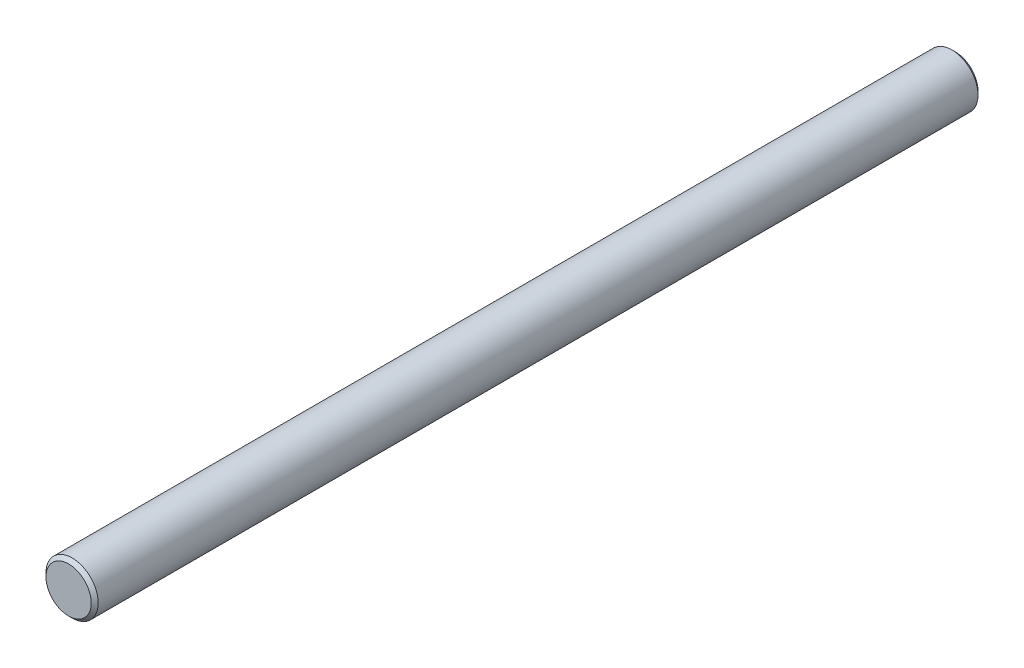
ISO-10303-21;
HEADER;
FILE_DESCRIPTION(('STEP AP214'),'2;1');
FILE_NAME('part.step','',(''),(''),'','','');
FILE_SCHEMA(('AUTOMOTIVE_DESIGN { 1 0 10303 214 1 1 1 1 }'));
ENDSEC;
DATA;
#1=APPLICATION_CONTEXT('core data for automotive mechanical design processes');
#2=APPLICATION_PROTOCOL_DEFINITION('international standard','automotive_design',2000,#1);
#3=PRODUCT_CONTEXT('',#1,'mechanical');
#4=PRODUCT('Part','Part','',(#3));
#5=PRODUCT_RELATED_PRODUCT_CATEGORY('part','',(#4));
#6=PRODUCT_DEFINITION_FORMATION('','',#4);
#7=PRODUCT_DEFINITION_CONTEXT('part definition',#1,'design');
#8=PRODUCT_DEFINITION('design','',#6,#7);
#9=PRODUCT_DEFINITION_SHAPE('','',#8);
#10=(LENGTH_UNIT() NAMED_UNIT(*) SI_UNIT(.MILLI.,.METRE.));
#11=(NAMED_UNIT(*) PLANE_ANGLE_UNIT() SI_UNIT($,.RADIAN.));
#12=(NAMED_UNIT(*) SI_UNIT($,.STERADIAN.) SOLID_ANGLE_UNIT());
#13=UNCERTAINTY_MEASURE_WITH_UNIT(LENGTH_MEASURE(1.E-05),#10,'distance_accuracy_value','');
#14=(GEOMETRIC_REPRESENTATION_CONTEXT(3) GLOBAL_UNCERTAINTY_ASSIGNED_CONTEXT((#13)) GLOBAL_UNIT_ASSIGNED_CONTEXT((#10,
#11,#12)) REPRESENTATION_CONTEXT('',''));
#15=CARTESIAN_POINT('',(0.,0.,0.));
#16=DIRECTION('',(0.,0.,1.));
#17=DIRECTION('',(1.,0.,0.));
#18=AXIS2_PLACEMENT_3D('',#15,#16,#17);
#19=CARTESIAN_POINT('',(-0.6578,-0.6578,-25.5));
#20=DIRECTION('',(0.,0.,1.));
#21=DIRECTION('',(1.,0.,0.));
#22=AXIS2_PLACEMENT_3D('',#19,#20,#21);
#23=PLANE('',#22);
#24=CARTESIAN_POINT('',(0.,0.,-25.5));
#25=DIRECTION('',(0.,0.,1.));
#26=DIRECTION('',(1.,0.,0.));
#27=AXIS2_PLACEMENT_3D('',#24,#25,#26);
#28=CIRCLE('',#27,0.650000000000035);
#29=CARTESIAN_POINT('',(0.650000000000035,0.,-25.5));
#30=VERTEX_POINT('',#29);
#31=EDGE_CURVE('E19',#30,#30,#28,.F.);
#32=ORIENTED_EDGE('',*,*,#31,.T.);
#33=EDGE_LOOP('',(#32));
#34=FACE_BOUND('',#33,.T.);
#35=ADVANCED_FACE('F15',(#34),#23,.F.);
#36=CARTESIAN_POINT('',(0.,0.,-25.5));
#37=DIRECTION('',(0.,0.,1.));
#38=DIRECTION('',(1.,0.,0.));
#39=AXIS2_PLACEMENT_3D('',#36,#37,#38);
#40=CONICAL_SURFACE('',#39,0.65,0.785398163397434);
#41=ORIENTED_EDGE('',*,*,#31,.F.);
#42=EDGE_LOOP('',(#41));
#43=FACE_BOUND('',#42,.T.);
#44=CARTESIAN_POINT('',(0.,0.,-25.4));
#45=DIRECTION('',(0.,0.,1.));
#46=DIRECTION('',(1.,0.,0.));
#47=AXIS2_PLACEMENT_3D('',#44,#45,#46);
#48=CIRCLE('',#47,0.75);
#49=CARTESIAN_POINT('',(0.75,0.,-25.4));
#50=VERTEX_POINT('',#49);
#51=EDGE_CURVE('E27',#50,#50,#48,.F.);
#52=ORIENTED_EDGE('',*,*,#51,.T.);
#53=EDGE_LOOP('',(#52));
#54=FACE_BOUND('',#53,.T.);
#55=ADVANCED_FACE('F37',(#43,#54),#40,.T.);
#56=CARTESIAN_POINT('',(0.,0.,-25.4));
#57=DIRECTION('',(0.,0.,1.));
#58=DIRECTION('',(1.,0.,0.));
#59=AXIS2_PLACEMENT_3D('',#56,#57,#58);
#60=CYLINDRICAL_SURFACE('',#59,0.75);
#61=CARTESIAN_POINT('',(0.,0.,-0.099999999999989));
#62=DIRECTION('',(0.,0.,-1.));
#63=DIRECTION('',(-1.,0.,0.));
#64=AXIS2_PLACEMENT_3D('',#61,#62,#63);
#65=CIRCLE('',#64,0.75);
#66=CARTESIAN_POINT('',(-0.75,0.,-0.1));
#67=VERTEX_POINT('',#66);
#68=EDGE_CURVE('E23',#67,#67,#65,.T.);
#69=ORIENTED_EDGE('',*,*,#68,.T.);
#70=EDGE_LOOP('',(#69));
#71=FACE_BOUND('',#70,.T.);
#72=ORIENTED_EDGE('',*,*,#51,.F.);
#73=EDGE_LOOP('',(#72));
#74=FACE_BOUND('',#73,.T.);
#75=ADVANCED_FACE('F39',(#71,#74),#60,.T.);
#76=CARTESIAN_POINT('',(-0.6578,-0.6578,0.));
#77=DIRECTION('',(0.,0.,1.));
#78=DIRECTION('',(1.,0.,0.));
#79=AXIS2_PLACEMENT_3D('',#76,#77,#78);
#80=PLANE('',#79);
#81=CARTESIAN_POINT('',(0.,0.,0.));
#82=DIRECTION('',(0.,0.,-1.));
#83=DIRECTION('',(-1.,0.,0.));
#84=AXIS2_PLACEMENT_3D('',#81,#82,#83);
#85=CIRCLE('',#84,0.65);
#86=CARTESIAN_POINT('',(-0.65,0.,0.));
#87=VERTEX_POINT('',#86);
#88=EDGE_CURVE('E10',#87,#87,#85,.F.);
#89=ORIENTED_EDGE('',*,*,#88,.T.);
#90=EDGE_LOOP('',(#89));
#91=FACE_BOUND('',#90,.T.);
#92=ADVANCED_FACE('F17',(#91),#80,.T.);
#93=CARTESIAN_POINT('',(0.,0.,0.));
#94=DIRECTION('',(0.,0.,-1.));
#95=DIRECTION('',(-1.,0.,0.));
#96=AXIS2_PLACEMENT_3D('',#93,#94,#95);
#97=CONICAL_SURFACE('',#96,0.65,0.785398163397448);
#98=ORIENTED_EDGE('',*,*,#88,.F.);
#99=EDGE_LOOP('',(#98));
#100=FACE_BOUND('',#99,.T.);
#101=ORIENTED_EDGE('',*,*,#68,.F.);
#102=EDGE_LOOP('',(#101));
#103=FACE_BOUND('',#102,.T.);
#104=ADVANCED_FACE('F49',(#100,#103),#97,.T.);
#105=CLOSED_SHELL('',(#35,#55,#75,#92,#104));
#106=MANIFOLD_SOLID_BREP('B1',#105);
#107=ADVANCED_BREP_SHAPE_REPRESENTATION('',(#18,#106),#14);
#108=SHAPE_DEFINITION_REPRESENTATION(#9,#107);
ENDSEC;
END-ISO-10303-21;
